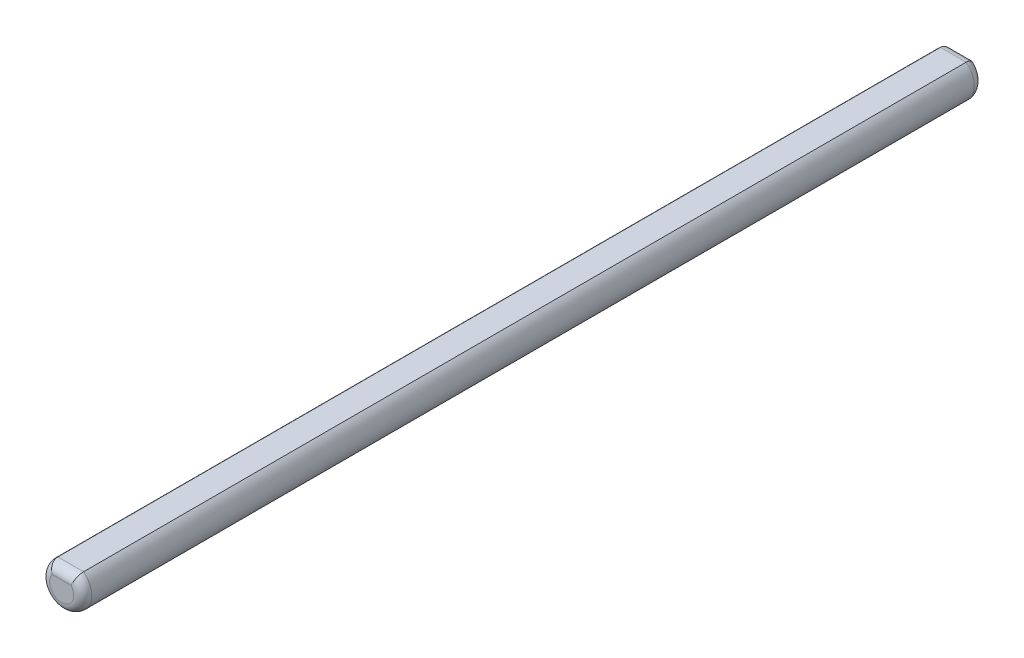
ISO-10303-21;
HEADER;
FILE_DESCRIPTION(('STEP AP214'),'2;1');
FILE_NAME('part.step','',(''),(''),'','','');
FILE_SCHEMA(('AUTOMOTIVE_DESIGN { 1 0 10303 214 1 1 1 1 }'));
ENDSEC;
DATA;
#1=APPLICATION_CONTEXT('core data for automotive mechanical design processes');
#2=APPLICATION_PROTOCOL_DEFINITION('international standard','automotive_design',2000,#1);
#3=PRODUCT_CONTEXT('',#1,'mechanical');
#4=PRODUCT('Part','Part','',(#3));
#5=PRODUCT_RELATED_PRODUCT_CATEGORY('part','',(#4));
#6=PRODUCT_DEFINITION_FORMATION('','',#4);
#7=PRODUCT_DEFINITION_CONTEXT('part definition',#1,'design');
#8=PRODUCT_DEFINITION('design','',#6,#7);
#9=PRODUCT_DEFINITION_SHAPE('','',#8);
#10=(LENGTH_UNIT() NAMED_UNIT(*) SI_UNIT(.MILLI.,.METRE.));
#11=(NAMED_UNIT(*) PLANE_ANGLE_UNIT() SI_UNIT($,.RADIAN.));
#12=(NAMED_UNIT(*) SI_UNIT($,.STERADIAN.) SOLID_ANGLE_UNIT());
#13=UNCERTAINTY_MEASURE_WITH_UNIT(LENGTH_MEASURE(1.E-05),#10,'distance_accuracy_value','');
#14=(GEOMETRIC_REPRESENTATION_CONTEXT(3) GLOBAL_UNCERTAINTY_ASSIGNED_CONTEXT((#13)) GLOBAL_UNIT_ASSIGNED_CONTEXT((#10,
#11,#12)) REPRESENTATION_CONTEXT('',''));
#15=CARTESIAN_POINT('',(0.,0.,0.));
#16=DIRECTION('',(0.,0.,1.));
#17=DIRECTION('',(1.,0.,0.));
#18=AXIS2_PLACEMENT_3D('',#15,#16,#17);
#19=CARTESIAN_POINT('',(0.,0.,50.));
#20=DIRECTION('',(0.,0.,-1.));
#21=DIRECTION('',(-1.,0.,0.));
#22=AXIS2_PLACEMENT_3D('',#19,#20,#21);
#23=CYLINDRICAL_SURFACE('',#22,2.335);
#24=DIRECTION('',(0.,0.,-1.));
#25=VECTOR('',#24,1.);
#26=CARTESIAN_POINT('',(-1.43115338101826,1.845,50.));
#27=LINE('',#26,#25);
#28=CARTESIAN_POINT('',(-1.43115338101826,1.845,49.));
#29=VERTEX_POINT('',#28);
#30=CARTESIAN_POINT('',(-1.43115338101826,1.845,-49.));
#31=VERTEX_POINT('',#30);
#32=EDGE_CURVE('E100',#29,#31,#27,.T.);
#33=ORIENTED_EDGE('',*,*,#32,.T.);
#34=CARTESIAN_POINT('',(0.,0.,-49.));
#35=DIRECTION('',(0.,0.,1.));
#36=DIRECTION('',(1.,0.,0.));
#37=AXIS2_PLACEMENT_3D('',#34,#35,#36);
#38=CIRCLE('',#37,2.335);
#39=CARTESIAN_POINT('',(1.43115338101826,1.845,-49.));
#40=VERTEX_POINT('',#39);
#41=EDGE_CURVE('E103',#31,#40,#38,.T.);
#42=ORIENTED_EDGE('',*,*,#41,.T.);
#43=DIRECTION('',(0.,0.,-1.));
#44=VECTOR('',#43,1.);
#45=CARTESIAN_POINT('',(1.43115338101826,1.845,50.));
#46=LINE('',#45,#44);
#47=CARTESIAN_POINT('',(1.43115338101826,1.845,49.));
#48=VERTEX_POINT('',#47);
#49=EDGE_CURVE('E97',#48,#40,#46,.T.);
#50=ORIENTED_EDGE('',*,*,#49,.F.);
#51=CARTESIAN_POINT('',(0.,0.,49.));
#52=DIRECTION('',(0.,0.,1.));
#53=DIRECTION('',(1.,0.,0.));
#54=AXIS2_PLACEMENT_3D('',#51,#52,#53);
#55=CIRCLE('',#54,2.335);
#56=EDGE_CURVE('E92',#48,#29,#55,.F.);
#57=ORIENTED_EDGE('',*,*,#56,.T.);
#58=EDGE_LOOP('',(#33,#42,#50,#57));
#59=FACE_BOUND('',#58,.T.);
#60=ADVANCED_FACE('F44',(#59),#23,.T.);
#61=CARTESIAN_POINT('',(1.43115338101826,1.845,50.));
#62=DIRECTION('',(0.,-1.,0.));
#63=DIRECTION('',(1.,0.,0.));
#64=AXIS2_PLACEMENT_3D('',#61,#62,#63);
#65=PLANE('',#64);
#66=ORIENTED_EDGE('',*,*,#49,.T.);
#67=DIRECTION('',(-1.,0.,0.));
#68=VECTOR('',#67,1.);
#69=CARTESIAN_POINT('',(1.43115338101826,1.845,-49.));
#70=LINE('',#69,#68);
#71=EDGE_CURVE('E112',#40,#31,#70,.T.);
#72=ORIENTED_EDGE('',*,*,#71,.T.);
#73=ORIENTED_EDGE('',*,*,#32,.F.);
#74=DIRECTION('',(-1.,0.,0.));
#75=VECTOR('',#74,1.);
#76=CARTESIAN_POINT('',(1.43115338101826,1.845,49.));
#77=LINE('',#76,#75);
#78=EDGE_CURVE('E108',#29,#48,#77,.F.);
#79=ORIENTED_EDGE('',*,*,#78,.T.);
#80=EDGE_LOOP('',(#66,#72,#73,#79));
#81=FACE_BOUND('',#80,.T.);
#82=ADVANCED_FACE('F107',(#81),#65,.F.);
#83=CARTESIAN_POINT('',(0.,0.,50.));
#84=DIRECTION('',(0.,0.,1.));
#85=DIRECTION('',(1.,0.,0.));
#86=AXIS2_PLACEMENT_3D('',#83,#84,#85);
#87=PLANE('',#86);
#88=CARTESIAN_POINT('',(0.,0.,50.));
#89=DIRECTION('',(0.,0.,1.));
#90=DIRECTION('',(1.,0.,0.));
#91=AXIS2_PLACEMENT_3D('',#88,#89,#90);
#92=CIRCLE('',#91,1.335);
#93=CARTESIAN_POINT('',(-1.03353761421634,0.845,50.));
#94=VERTEX_POINT('',#93);
#95=CARTESIAN_POINT('',(1.03353761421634,0.845,50.));
#96=VERTEX_POINT('',#95);
#97=EDGE_CURVE('E58',#94,#96,#92,.T.);
#98=ORIENTED_EDGE('',*,*,#97,.T.);
#99=DIRECTION('',(-1.,0.,0.));
#100=VECTOR('',#99,1.);
#101=CARTESIAN_POINT('',(-1.43115338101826,0.845,50.));
#102=LINE('',#101,#100);
#103=EDGE_CURVE('E11',#96,#94,#102,.T.);
#104=ORIENTED_EDGE('',*,*,#103,.T.);
#105=EDGE_LOOP('',(#98,#104));
#106=FACE_BOUND('',#105,.T.);
#107=ADVANCED_FACE('F175',(#106),#87,.T.);
#108=CARTESIAN_POINT('',(0.,0.,-50.));
#109=DIRECTION('',(0.,0.,1.));
#110=DIRECTION('',(1.,0.,0.));
#111=AXIS2_PLACEMENT_3D('',#108,#109,#110);
#112=PLANE('',#111);
#113=CARTESIAN_POINT('',(0.,0.,-50.));
#114=DIRECTION('',(0.,0.,1.));
#115=DIRECTION('',(1.,0.,0.));
#116=AXIS2_PLACEMENT_3D('',#113,#114,#115);
#117=CIRCLE('',#116,1.335);
#118=CARTESIAN_POINT('',(1.03353761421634,0.845,-50.));
#119=VERTEX_POINT('',#118);
#120=CARTESIAN_POINT('',(-1.03353761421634,0.845,-50.));
#121=VERTEX_POINT('',#120);
#122=EDGE_CURVE('E160',#119,#121,#117,.F.);
#123=ORIENTED_EDGE('',*,*,#122,.T.);
#124=DIRECTION('',(-1.,0.,0.));
#125=VECTOR('',#124,1.);
#126=CARTESIAN_POINT('',(0.,0.845,-50.));
#127=LINE('',#126,#125);
#128=EDGE_CURVE('E102',#121,#119,#127,.F.);
#129=ORIENTED_EDGE('',*,*,#128,.T.);
#130=EDGE_LOOP('',(#123,#129));
#131=FACE_BOUND('',#130,.T.);
#132=ADVANCED_FACE('F172',(#131),#112,.F.);
#133=CARTESIAN_POINT('',(0.,0.,-49.));
#134=DIRECTION('',(0.,0.,1.));
#135=DIRECTION('',(1.,0.,0.));
#136=AXIS2_PLACEMENT_3D('',#133,#134,#135);
#137=TOROIDAL_SURFACE('',#136,1.335,1.);
#138=CARTESIAN_POINT('',(-1.43115338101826,1.845,-49.));
#139=CARTESIAN_POINT('',(-1.43115309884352,1.84500055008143,-49.0269621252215));
#140=CARTESIAN_POINT('',(-1.43077983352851,1.84390881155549,-49.0539110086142));
#141=CARTESIAN_POINT('',(-1.42928933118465,1.83955834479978,-49.1076089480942));
#142=CARTESIAN_POINT('',(-1.42817219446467,1.83629990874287,-49.1343580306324));
#143=CARTESIAN_POINT('',(-1.42371626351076,1.82332507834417,-49.2139057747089));
#144=CARTESIAN_POINT('',(-1.41927291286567,1.81040893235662,-49.2661598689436));
#145=CARTESIAN_POINT('',(-1.40752355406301,1.77651875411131,-49.3676108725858));
#146=CARTESIAN_POINT('',(-1.40021738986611,1.75554428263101,-49.4168076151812));
#147=CARTESIAN_POINT('',(-1.38287405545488,1.70629141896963,-49.5108767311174));
#148=CARTESIAN_POINT('',(-1.3728365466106,1.67801212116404,-49.5557485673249));
#149=CARTESIAN_POINT('',(-1.34998700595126,1.6145226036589,-49.6408647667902));
#150=CARTESIAN_POINT('',(-1.33712606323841,1.57919134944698,-49.6810054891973));
#151=CARTESIAN_POINT('',(-1.30895327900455,1.50312287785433,-49.7547734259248));
#152=CARTESIAN_POINT('',(-1.29364080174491,1.46238425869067,-49.7883989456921));
#153=CARTESIAN_POINT('',(-1.25997904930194,1.37464314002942,-49.8499950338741));
#154=CARTESIAN_POINT('',(-1.24151713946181,1.32743064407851,-49.8776042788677));
#155=CARTESIAN_POINT('',(-1.2024053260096,1.22989436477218,-49.9245464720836));
#156=CARTESIAN_POINT('',(-1.18175479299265,1.17956968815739,-49.9438770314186));
#157=CARTESIAN_POINT('',(-1.14093371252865,1.08291823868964,-49.9724453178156));
#158=CARTESIAN_POINT('',(-1.12096109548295,1.03676211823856,-49.9825605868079));
#159=CARTESIAN_POINT('',(-1.07971087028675,0.944134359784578,-49.9961711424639));
#160=CARTESIAN_POINT('',(-1.05843572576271,0.897663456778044,-49.9996785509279));
#161=CARTESIAN_POINT('',(-1.03558918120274,0.849330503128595,-49.9999929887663));
#162=CARTESIAN_POINT('',(-1.03456399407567,0.847164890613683,-50.0000000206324));
#163=CARTESIAN_POINT('',(-1.03353761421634,0.845,-50.));
#164=B_SPLINE_CURVE_WITH_KNOTS('',3,(#138,#139,#140,#141,#142,#143,#144,#145,#146,#147,#148,
#149,#150,#151,#152,#153,#154,#155,#156,#157,#158,#159,#160,#161,#162,#163),.UNSPECIFIED.,.F.,
.F.,(4,2,2,2,2,2,2,2,2,2,2,2,4),(0.,0.0808355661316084,0.16166023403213,0.3228508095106,
0.484050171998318,0.645269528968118,0.809539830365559,0.973852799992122,1.14628119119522,
1.31875930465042,1.47222846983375,1.6254158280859,1.63260385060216),.UNSPECIFIED.);
#165=EDGE_CURVE('E118',#121,#31,#164,.F.);
#166=ORIENTED_EDGE('',*,*,#165,.F.);
#167=ORIENTED_EDGE('',*,*,#122,.F.);
#168=CARTESIAN_POINT('',(1.43115338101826,1.845,-49.));
#169=CARTESIAN_POINT('',(1.43115309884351,1.84500055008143,-49.0269621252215));
#170=CARTESIAN_POINT('',(1.43077983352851,1.84390881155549,-49.0539110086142));
#171=CARTESIAN_POINT('',(1.42928933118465,1.83955834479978,-49.1076089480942));
#172=CARTESIAN_POINT('',(1.42817219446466,1.83629990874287,-49.1343580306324));
#173=CARTESIAN_POINT('',(1.42371626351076,1.82332507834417,-49.2139057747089));
#174=CARTESIAN_POINT('',(1.41927291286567,1.81040893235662,-49.2661598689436));
#175=CARTESIAN_POINT('',(1.40752355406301,1.77651875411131,-49.3676108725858));
#176=CARTESIAN_POINT('',(1.40021738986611,1.75554428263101,-49.4168076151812));
#177=CARTESIAN_POINT('',(1.38287405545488,1.70629141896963,-49.5108767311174));
#178=CARTESIAN_POINT('',(1.3728365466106,1.67801212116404,-49.5557485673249));
#179=CARTESIAN_POINT('',(1.34998700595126,1.6145226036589,-49.6408647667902));
#180=CARTESIAN_POINT('',(1.3371260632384,1.57919134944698,-49.6810054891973));
#181=CARTESIAN_POINT('',(1.30895327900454,1.50312287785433,-49.7547734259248));
#182=CARTESIAN_POINT('',(1.29364080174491,1.46238425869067,-49.7883989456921));
#183=CARTESIAN_POINT('',(1.25997904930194,1.37464314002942,-49.8499950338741));
#184=CARTESIAN_POINT('',(1.2415171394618,1.32743064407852,-49.8776042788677));
#185=CARTESIAN_POINT('',(1.2024053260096,1.22989436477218,-49.9245464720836));
#186=CARTESIAN_POINT('',(1.18175479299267,1.17956968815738,-49.9438770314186));
#187=CARTESIAN_POINT('',(1.14093371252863,1.08291823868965,-49.9724453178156));
#188=CARTESIAN_POINT('',(1.12096109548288,1.03676211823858,-49.9825605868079));
#189=CARTESIAN_POINT('',(1.07971087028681,0.944134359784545,-49.9961711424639));
#190=CARTESIAN_POINT('',(1.05843572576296,0.897663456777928,-49.9996785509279));
#191=CARTESIAN_POINT('',(1.03558918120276,0.849330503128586,-49.9999929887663));
#192=CARTESIAN_POINT('',(1.03456399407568,0.847164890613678,-50.0000000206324));
#193=CARTESIAN_POINT('',(1.03353761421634,0.845,-50.));
#194=B_SPLINE_CURVE_WITH_KNOTS('',3,(#168,#169,#170,#171,#172,#173,#174,#175,#176,#177,#178,
#179,#180,#181,#182,#183,#184,#185,#186,#187,#188,#189,#190,#191,#192,#193),.UNSPECIFIED.,.F.,
.F.,(4,2,2,2,2,2,2,2,2,2,2,2,4),(0.,0.0808355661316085,0.16166023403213,0.3228508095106,
0.484050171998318,0.645269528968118,0.809539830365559,0.973852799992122,1.14628119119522,
1.31875930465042,1.47222846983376,1.6254158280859,1.63260385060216),.UNSPECIFIED.);
#195=EDGE_CURVE('E114',#40,#119,#194,.T.);
#196=ORIENTED_EDGE('',*,*,#195,.F.);
#197=ORIENTED_EDGE('',*,*,#41,.F.);
#198=EDGE_LOOP('',(#166,#167,#196,#197));
#199=FACE_BOUND('',#198,.T.);
#200=ADVANCED_FACE('F138',(#199),#137,.T.);
#201=CARTESIAN_POINT('',(1.43115338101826,0.845,-49.));
#202=DIRECTION('',(-1.,0.,0.));
#203=DIRECTION('',(0.,-1.,0.));
#204=AXIS2_PLACEMENT_3D('',#201,#202,#203);
#205=CYLINDRICAL_SURFACE('',#204,1.);
#206=ORIENTED_EDGE('',*,*,#195,.T.);
#207=ORIENTED_EDGE('',*,*,#128,.F.);
#208=ORIENTED_EDGE('',*,*,#165,.T.);
#209=ORIENTED_EDGE('',*,*,#71,.F.);
#210=EDGE_LOOP('',(#206,#207,#208,#209));
#211=FACE_BOUND('',#210,.T.);
#212=ADVANCED_FACE('F133',(#211),#205,.T.);
#213=CARTESIAN_POINT('',(0.,0.,49.));
#214=DIRECTION('',(0.,0.,1.));
#215=DIRECTION('',(1.,0.,0.));
#216=AXIS2_PLACEMENT_3D('',#213,#214,#215);
#217=TOROIDAL_SURFACE('',#216,1.335,1.);
#218=CARTESIAN_POINT('',(-1.43115338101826,1.845,49.));
#219=CARTESIAN_POINT('',(-1.43115309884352,1.84500055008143,49.0269621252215));
#220=CARTESIAN_POINT('',(-1.43077983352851,1.84390881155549,49.0539110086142));
#221=CARTESIAN_POINT('',(-1.42928933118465,1.83955834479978,49.1076089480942));
#222=CARTESIAN_POINT('',(-1.42817219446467,1.83629990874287,49.1343580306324));
#223=CARTESIAN_POINT('',(-1.42371626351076,1.82332507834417,49.2139057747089));
#224=CARTESIAN_POINT('',(-1.41927291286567,1.81040893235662,49.2661598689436));
#225=CARTESIAN_POINT('',(-1.40752355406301,1.77651875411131,49.3676108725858));
#226=CARTESIAN_POINT('',(-1.40021738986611,1.75554428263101,49.4168076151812));
#227=CARTESIAN_POINT('',(-1.38287405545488,1.70629141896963,49.5108767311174));
#228=CARTESIAN_POINT('',(-1.3728365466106,1.67801212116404,49.5557485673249));
#229=CARTESIAN_POINT('',(-1.34998700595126,1.6145226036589,49.6408647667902));
#230=CARTESIAN_POINT('',(-1.33712606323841,1.57919134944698,49.6810054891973));
#231=CARTESIAN_POINT('',(-1.30895327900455,1.50312287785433,49.7547734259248));
#232=CARTESIAN_POINT('',(-1.29364080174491,1.46238425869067,49.7883989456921));
#233=CARTESIAN_POINT('',(-1.25997904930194,1.37464314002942,49.8499950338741));
#234=CARTESIAN_POINT('',(-1.24151713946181,1.32743064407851,49.8776042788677));
#235=CARTESIAN_POINT('',(-1.2024053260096,1.22989436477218,49.9245464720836));
#236=CARTESIAN_POINT('',(-1.18175479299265,1.17956968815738,49.9438770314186));
#237=CARTESIAN_POINT('',(-1.14093371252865,1.08291823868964,49.9724453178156));
#238=CARTESIAN_POINT('',(-1.12096109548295,1.03676211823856,49.9825605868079));
#239=CARTESIAN_POINT('',(-1.07971087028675,0.944134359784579,49.9961711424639));
#240=CARTESIAN_POINT('',(-1.05843572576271,0.897663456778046,49.9996785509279));
#241=CARTESIAN_POINT('',(-1.03558918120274,0.849330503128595,49.9999929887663));
#242=CARTESIAN_POINT('',(-1.03456399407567,0.847164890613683,50.0000000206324));
#243=CARTESIAN_POINT('',(-1.03353761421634,0.845,50.));
#244=B_SPLINE_CURVE_WITH_KNOTS('',3,(#218,#219,#220,#221,#222,#223,#224,#225,#226,#227,#228,
#229,#230,#231,#232,#233,#234,#235,#236,#237,#238,#239,#240,#241,#242,#243),.UNSPECIFIED.,.F.,
.F.,(4,2,2,2,2,2,2,2,2,2,2,2,4),(0.,0.0808355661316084,0.16166023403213,0.3228508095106,
0.484050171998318,0.645269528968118,0.809539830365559,0.973852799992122,1.14628119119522,
1.31875930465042,1.47222846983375,1.6254158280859,1.63260385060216),.UNSPECIFIED.);
#245=EDGE_CURVE('E71',#29,#94,#244,.T.);
#246=ORIENTED_EDGE('',*,*,#245,.F.);
#247=ORIENTED_EDGE('',*,*,#56,.F.);
#248=CARTESIAN_POINT('',(1.43115338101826,1.845,49.));
#249=CARTESIAN_POINT('',(1.43115309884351,1.84500055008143,49.0269621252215));
#250=CARTESIAN_POINT('',(1.43077983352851,1.84390881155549,49.0539110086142));
#251=CARTESIAN_POINT('',(1.42928933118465,1.83955834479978,49.1076089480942));
#252=CARTESIAN_POINT('',(1.42817219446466,1.83629990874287,49.1343580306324));
#253=CARTESIAN_POINT('',(1.42371626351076,1.82332507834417,49.2139057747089));
#254=CARTESIAN_POINT('',(1.41927291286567,1.81040893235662,49.2661598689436));
#255=CARTESIAN_POINT('',(1.40752355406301,1.77651875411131,49.3676108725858));
#256=CARTESIAN_POINT('',(1.40021738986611,1.75554428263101,49.4168076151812));
#257=CARTESIAN_POINT('',(1.38287405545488,1.70629141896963,49.5108767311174));
#258=CARTESIAN_POINT('',(1.3728365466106,1.67801212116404,49.5557485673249));
#259=CARTESIAN_POINT('',(1.34998700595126,1.6145226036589,49.6408647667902));
#260=CARTESIAN_POINT('',(1.33712606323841,1.57919134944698,49.6810054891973));
#261=CARTESIAN_POINT('',(1.30895327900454,1.50312287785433,49.7547734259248));
#262=CARTESIAN_POINT('',(1.29364080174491,1.46238425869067,49.7883989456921));
#263=CARTESIAN_POINT('',(1.25997904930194,1.37464314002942,49.8499950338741));
#264=CARTESIAN_POINT('',(1.24151713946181,1.32743064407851,49.8776042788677));
#265=CARTESIAN_POINT('',(1.2024053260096,1.22989436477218,49.9245464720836));
#266=CARTESIAN_POINT('',(1.18175479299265,1.17956968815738,49.9438770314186));
#267=CARTESIAN_POINT('',(1.14093371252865,1.08291823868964,49.9724453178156));
#268=CARTESIAN_POINT('',(1.12096109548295,1.03676211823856,49.9825605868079));
#269=CARTESIAN_POINT('',(1.07971087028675,0.944134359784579,49.9961711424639));
#270=CARTESIAN_POINT('',(1.05843572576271,0.897663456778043,49.9996785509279));
#271=CARTESIAN_POINT('',(1.03558918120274,0.849330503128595,49.9999929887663));
#272=CARTESIAN_POINT('',(1.03456399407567,0.847164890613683,50.0000000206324));
#273=CARTESIAN_POINT('',(1.03353761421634,0.845,50.));
#274=B_SPLINE_CURVE_WITH_KNOTS('',3,(#248,#249,#250,#251,#252,#253,#254,#255,#256,#257,#258,
#259,#260,#261,#262,#263,#264,#265,#266,#267,#268,#269,#270,#271,#272,#273),.UNSPECIFIED.,.F.,
.F.,(4,2,2,2,2,2,2,2,2,2,2,2,4),(0.,0.0808355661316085,0.16166023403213,0.3228508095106,
0.484050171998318,0.645269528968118,0.809539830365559,0.973852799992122,1.14628119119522,
1.31875930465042,1.47222846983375,1.6254158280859,1.63260385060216),.UNSPECIFIED.);
#275=EDGE_CURVE('E49',#96,#48,#274,.F.);
#276=ORIENTED_EDGE('',*,*,#275,.F.);
#277=ORIENTED_EDGE('',*,*,#97,.F.);
#278=EDGE_LOOP('',(#246,#247,#276,#277));
#279=FACE_BOUND('',#278,.T.);
#280=ADVANCED_FACE('F50',(#279),#217,.T.);
#281=CARTESIAN_POINT('',(0.,0.845,49.));
#282=DIRECTION('',(1.,0.,0.));
#283=DIRECTION('',(0.,1.,0.));
#284=AXIS2_PLACEMENT_3D('',#281,#282,#283);
#285=CYLINDRICAL_SURFACE('',#284,1.);
#286=ORIENTED_EDGE('',*,*,#275,.T.);
#287=ORIENTED_EDGE('',*,*,#78,.F.);
#288=ORIENTED_EDGE('',*,*,#245,.T.);
#289=ORIENTED_EDGE('',*,*,#103,.F.);
#290=EDGE_LOOP('',(#286,#287,#288,#289));
#291=FACE_BOUND('',#290,.T.);
#292=ADVANCED_FACE('F113',(#291),#285,.T.);
#293=CLOSED_SHELL('',(#60,#82,#107,#132,#200,#212,#280,#292));
#294=MANIFOLD_SOLID_BREP('B2',#293);
#295=ADVANCED_BREP_SHAPE_REPRESENTATION('',(#18,#294),#14);
#296=SHAPE_DEFINITION_REPRESENTATION(#9,#295);
ENDSEC;
END-ISO-10303-21;
